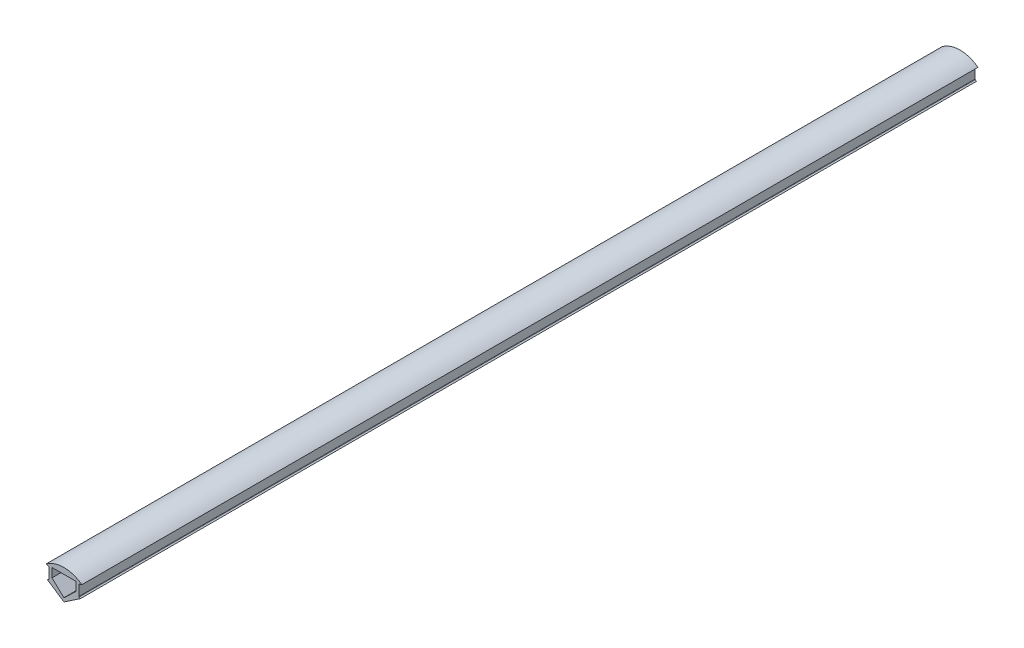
from build123d import *

# Parameters (mm, degrees)
EXTRUDE_1_DEPTH = 150


with BuildPart() as part:
    # Sketch 1 → Extrude 1 (new, symmetric)
    with BuildSketch(Plane.XY):
        with BuildLine():
            Line((6, 3), (5.141928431, 2.739635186))
            ThreePointArc((5.141928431, 2.739635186), (5.039353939, 2.667385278), (5, 2.548251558))
            Line((5, 2.548251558), (5, 2))
            Line((5, 2), (5, -0.889002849))
            ThreePointArc((5, -0.889002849), (5.02512626, -0.986055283), (5.094191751, -1.058722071))
            Line((5.094191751, -1.058722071), (5.5, -1.311715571))
            Line((5.5, -1.311715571), (0, -5))
            Line((0, -5), (-5.5, -1.311715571))
            Line((-5.5, -1.311715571), (-5.094191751, -1.058722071))
            ThreePointArc((-5.094191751, -1.058722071), (-5.02512626, -0.986055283), (-5, -0.889002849))
            Line((-5, -0.889002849), (-5, 2))
            Line((-5, 2), (-5, 2.548251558))
            ThreePointArc((-5, 2.548251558), (-5.039353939, 2.667385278), (-5.141928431, 2.739635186))
            Line((-5.141928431, 2.739635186), (-6, 3))
            ThreePointArc((-6, 3), (0, 5), (6, 3))
        make_face()
        Polygon((-4, 3), (-4, -0.016147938), (0, -3.767334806), (4, -0.016147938), (4, 3), align=None, mode=Mode.SUBTRACT)
    extrude(amount=EXTRUDE_1_DEPTH, both=True)


solid = part.part
